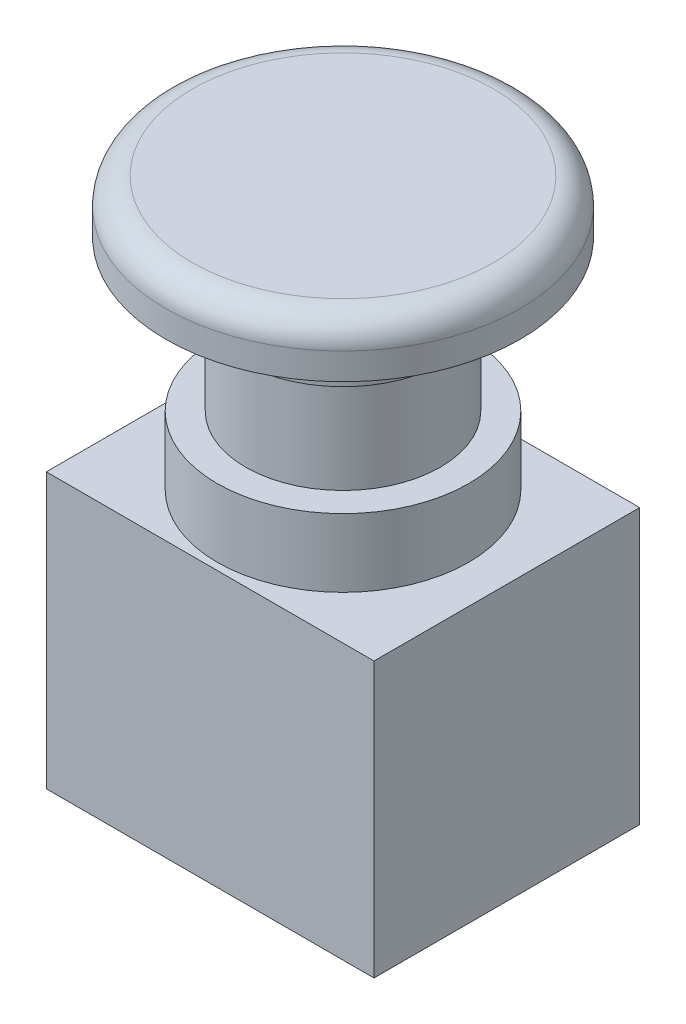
ISO-10303-21;
HEADER;
FILE_DESCRIPTION(('STEP AP214'),'2;1');
FILE_NAME('part.step','',(''),(''),'','','');
FILE_SCHEMA(('AUTOMOTIVE_DESIGN { 1 0 10303 214 1 1 1 1 }'));
ENDSEC;
DATA;
#1=APPLICATION_CONTEXT('core data for automotive mechanical design processes');
#2=APPLICATION_PROTOCOL_DEFINITION('international standard','automotive_design',2000,#1);
#3=PRODUCT_CONTEXT('',#1,'mechanical');
#4=PRODUCT('Part','Part','',(#3));
#5=PRODUCT_RELATED_PRODUCT_CATEGORY('part','',(#4));
#6=PRODUCT_DEFINITION_FORMATION('','',#4);
#7=PRODUCT_DEFINITION_CONTEXT('part definition',#1,'design');
#8=PRODUCT_DEFINITION('design','',#6,#7);
#9=PRODUCT_DEFINITION_SHAPE('','',#8);
#10=(LENGTH_UNIT() NAMED_UNIT(*) SI_UNIT(.MILLI.,.METRE.));
#11=(NAMED_UNIT(*) PLANE_ANGLE_UNIT() SI_UNIT($,.RADIAN.));
#12=(NAMED_UNIT(*) SI_UNIT($,.STERADIAN.) SOLID_ANGLE_UNIT());
#13=UNCERTAINTY_MEASURE_WITH_UNIT(LENGTH_MEASURE(1.E-05),#10,'distance_accuracy_value','');
#14=(GEOMETRIC_REPRESENTATION_CONTEXT(3) GLOBAL_UNCERTAINTY_ASSIGNED_CONTEXT((#13)) GLOBAL_UNIT_ASSIGNED_CONTEXT((#10,
#11,#12)) REPRESENTATION_CONTEXT('',''));
#15=CARTESIAN_POINT('',(0.,0.,0.));
#16=DIRECTION('',(0.,0.,1.));
#17=DIRECTION('',(1.,0.,0.));
#18=AXIS2_PLACEMENT_3D('',#15,#16,#17);
#19=CARTESIAN_POINT('',(18.5,31.,15.));
#20=DIRECTION('',(-1.,0.,0.));
#21=DIRECTION('',(0.,0.,1.));
#22=AXIS2_PLACEMENT_3D('',#19,#20,#21);
#23=PLANE('',#22);
#24=DIRECTION('',(0.,0.,-1.));
#25=VECTOR('',#24,1.);
#26=CARTESIAN_POINT('',(18.5,0.,15.));
#27=LINE('',#26,#25);
#28=CARTESIAN_POINT('',(18.5,0.,15.));
#29=VERTEX_POINT('',#28);
#30=CARTESIAN_POINT('',(18.5,0.,-15.));
#31=VERTEX_POINT('',#30);
#32=EDGE_CURVE('E107',#29,#31,#27,.T.);
#33=ORIENTED_EDGE('',*,*,#32,.T.);
#34=DIRECTION('',(0.,-1.,0.));
#35=VECTOR('',#34,1.);
#36=CARTESIAN_POINT('',(18.5,31.,-15.));
#37=LINE('',#36,#35);
#38=CARTESIAN_POINT('',(18.5,31.,-15.));
#39=VERTEX_POINT('',#38);
#40=EDGE_CURVE('E98',#39,#31,#37,.T.);
#41=ORIENTED_EDGE('',*,*,#40,.F.);
#42=DIRECTION('',(0.,0.,-1.));
#43=VECTOR('',#42,1.);
#44=CARTESIAN_POINT('',(18.5,31.,15.));
#45=LINE('',#44,#43);
#46=CARTESIAN_POINT('',(18.5,31.,15.));
#47=VERTEX_POINT('',#46);
#48=EDGE_CURVE('E92',#47,#39,#45,.T.);
#49=ORIENTED_EDGE('',*,*,#48,.F.);
#50=DIRECTION('',(0.,-1.,0.));
#51=VECTOR('',#50,1.);
#52=CARTESIAN_POINT('',(18.5,31.,15.));
#53=LINE('',#52,#51);
#54=EDGE_CURVE('E103',#47,#29,#53,.T.);
#55=ORIENTED_EDGE('',*,*,#54,.T.);
#56=EDGE_LOOP('',(#33,#41,#49,#55));
#57=FACE_BOUND('',#56,.T.);
#58=ADVANCED_FACE('F39',(#57),#23,.F.);
#59=CARTESIAN_POINT('',(-18.5,31.,-15.));
#60=DIRECTION('',(0.,0.,1.));
#61=DIRECTION('',(1.,0.,0.));
#62=AXIS2_PLACEMENT_3D('',#59,#60,#61);
#63=PLANE('',#62);
#64=DIRECTION('',(-1.,0.,0.));
#65=VECTOR('',#64,1.);
#66=CARTESIAN_POINT('',(-18.5,0.,-15.));
#67=LINE('',#66,#65);
#68=CARTESIAN_POINT('',(-18.5,0.,-15.));
#69=VERTEX_POINT('',#68);
#70=EDGE_CURVE('E97',#31,#69,#67,.T.);
#71=ORIENTED_EDGE('',*,*,#70,.T.);
#72=DIRECTION('',(0.,-1.,0.));
#73=VECTOR('',#72,1.);
#74=CARTESIAN_POINT('',(-18.5,31.,-15.));
#75=LINE('',#74,#73);
#76=CARTESIAN_POINT('',(-18.5,31.,-15.));
#77=VERTEX_POINT('',#76);
#78=EDGE_CURVE('E95',#77,#69,#75,.T.);
#79=ORIENTED_EDGE('',*,*,#78,.F.);
#80=DIRECTION('',(-1.,0.,0.));
#81=VECTOR('',#80,1.);
#82=CARTESIAN_POINT('',(-18.5,31.,-15.));
#83=LINE('',#82,#81);
#84=EDGE_CURVE('E87',#39,#77,#83,.T.);
#85=ORIENTED_EDGE('',*,*,#84,.F.);
#86=ORIENTED_EDGE('',*,*,#40,.T.);
#87=EDGE_LOOP('',(#71,#79,#85,#86));
#88=FACE_BOUND('',#87,.T.);
#89=ADVANCED_FACE('F96',(#88),#63,.F.);
#90=CARTESIAN_POINT('',(-18.5,31.,15.));
#91=DIRECTION('',(1.,0.,0.));
#92=DIRECTION('',(0.,0.,-1.));
#93=AXIS2_PLACEMENT_3D('',#90,#91,#92);
#94=PLANE('',#93);
#95=DIRECTION('',(0.,0.,1.));
#96=VECTOR('',#95,1.);
#97=CARTESIAN_POINT('',(-18.5,0.,15.));
#98=LINE('',#97,#96);
#99=CARTESIAN_POINT('',(-18.5,0.,15.));
#100=VERTEX_POINT('',#99);
#101=EDGE_CURVE('E73',#69,#100,#98,.T.);
#102=ORIENTED_EDGE('',*,*,#101,.T.);
#103=DIRECTION('',(0.,-1.,0.));
#104=VECTOR('',#103,1.);
#105=CARTESIAN_POINT('',(-18.5,31.,15.));
#106=LINE('',#105,#104);
#107=CARTESIAN_POINT('',(-18.5,31.,15.));
#108=VERTEX_POINT('',#107);
#109=EDGE_CURVE('E99',#108,#100,#106,.T.);
#110=ORIENTED_EDGE('',*,*,#109,.F.);
#111=DIRECTION('',(0.,0.,1.));
#112=VECTOR('',#111,1.);
#113=CARTESIAN_POINT('',(-18.5,31.,15.));
#114=LINE('',#113,#112);
#115=EDGE_CURVE('E90',#77,#108,#114,.T.);
#116=ORIENTED_EDGE('',*,*,#115,.F.);
#117=ORIENTED_EDGE('',*,*,#78,.T.);
#118=EDGE_LOOP('',(#102,#110,#116,#117));
#119=FACE_BOUND('',#118,.T.);
#120=ADVANCED_FACE('F101',(#119),#94,.F.);
#121=CARTESIAN_POINT('',(-18.5,31.,15.));
#122=DIRECTION('',(0.,0.,-1.));
#123=DIRECTION('',(-1.,0.,0.));
#124=AXIS2_PLACEMENT_3D('',#121,#122,#123);
#125=PLANE('',#124);
#126=DIRECTION('',(1.,0.,0.));
#127=VECTOR('',#126,1.);
#128=CARTESIAN_POINT('',(-18.5,0.,15.));
#129=LINE('',#128,#127);
#130=EDGE_CURVE('E79',#100,#29,#129,.T.);
#131=ORIENTED_EDGE('',*,*,#130,.T.);
#132=ORIENTED_EDGE('',*,*,#54,.F.);
#133=DIRECTION('',(1.,0.,0.));
#134=VECTOR('',#133,1.);
#135=CARTESIAN_POINT('',(-18.5,31.,15.));
#136=LINE('',#135,#134);
#137=EDGE_CURVE('E56',#108,#47,#136,.T.);
#138=ORIENTED_EDGE('',*,*,#137,.F.);
#139=ORIENTED_EDGE('',*,*,#109,.T.);
#140=EDGE_LOOP('',(#131,#132,#138,#139));
#141=FACE_BOUND('',#140,.T.);
#142=ADVANCED_FACE('F171',(#141),#125,.F.);
#143=CARTESIAN_POINT('',(0.,31.,0.));
#144=DIRECTION('',(0.,-1.,0.));
#145=DIRECTION('',(0.,0.,-1.));
#146=AXIS2_PLACEMENT_3D('',#143,#144,#145);
#147=PLANE('',#146);
#148=CARTESIAN_POINT('',(0.,31.,0.));
#149=DIRECTION('',(0.,1.,0.));
#150=DIRECTION('',(0.,0.,1.));
#151=AXIS2_PLACEMENT_3D('',#148,#149,#150);
#152=CIRCLE('',#151,14.2);
#153=CARTESIAN_POINT('',(0.,31.,-14.2));
#154=VERTEX_POINT('',#153);
#155=EDGE_CURVE('E116',#154,#154,#152,.T.);
#156=ORIENTED_EDGE('',*,*,#155,.F.);
#157=EDGE_LOOP('',(#156));
#158=FACE_BOUND('',#157,.T.);
#159=ORIENTED_EDGE('',*,*,#48,.T.);
#160=ORIENTED_EDGE('',*,*,#84,.T.);
#161=ORIENTED_EDGE('',*,*,#115,.T.);
#162=ORIENTED_EDGE('',*,*,#137,.T.);
#163=EDGE_LOOP('',(#159,#160,#161,#162));
#164=FACE_BOUND('',#163,.T.);
#165=ADVANCED_FACE('F88',(#158,#164),#147,.F.);
#166=CARTESIAN_POINT('',(0.,0.,0.));
#167=DIRECTION('',(0.,-1.,0.));
#168=DIRECTION('',(0.,0.,-1.));
#169=AXIS2_PLACEMENT_3D('',#166,#167,#168);
#170=PLANE('',#169);
#171=ORIENTED_EDGE('',*,*,#32,.F.);
#172=ORIENTED_EDGE('',*,*,#130,.F.);
#173=ORIENTED_EDGE('',*,*,#101,.F.);
#174=ORIENTED_EDGE('',*,*,#70,.F.);
#175=EDGE_LOOP('',(#171,#172,#173,#174));
#176=FACE_BOUND('',#175,.T.);
#177=ADVANCED_FACE('F174',(#176),#170,.T.);
#178=CARTESIAN_POINT('',(0.,38.7,0.));
#179=DIRECTION('',(0.,-1.,0.));
#180=DIRECTION('',(0.,0.,-1.));
#181=AXIS2_PLACEMENT_3D('',#178,#179,#180);
#182=CYLINDRICAL_SURFACE('',#181,14.2);
#183=CARTESIAN_POINT('',(0.,38.7,0.));
#184=DIRECTION('',(0.,1.,0.));
#185=DIRECTION('',(0.,0.,1.));
#186=AXIS2_PLACEMENT_3D('',#183,#184,#185);
#187=CIRCLE('',#186,14.2);
#188=CARTESIAN_POINT('',(0.,38.7,-14.2));
#189=VERTEX_POINT('',#188);
#190=EDGE_CURVE('E110',#189,#189,#187,.T.);
#191=CARTESIAN_POINT('',(0.,38.7,-14.2));
#192=CARTESIAN_POINT('',(0.,38.6197916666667,-14.2));
#193=CARTESIAN_POINT('',(0.,38.5395833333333,-14.2));
#194=CARTESIAN_POINT('',(0.,38.3791666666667,-14.2));
#195=CARTESIAN_POINT('',(0.,38.2989583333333,-14.2));
#196=CARTESIAN_POINT('',(0.,38.1385416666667,-14.2));
#197=CARTESIAN_POINT('',(0.,38.0583333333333,-14.2));
#198=CARTESIAN_POINT('',(0.,37.8979166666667,-14.2));
#199=CARTESIAN_POINT('',(0.,37.8177083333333,-14.2));
#200=CARTESIAN_POINT('',(0.,37.6572916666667,-14.2));
#201=CARTESIAN_POINT('',(0.,37.5770833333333,-14.2));
#202=CARTESIAN_POINT('',(0.,37.4166666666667,-14.2));
#203=CARTESIAN_POINT('',(0.,37.3364583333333,-14.2));
#204=CARTESIAN_POINT('',(0.,37.1760416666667,-14.2));
#205=CARTESIAN_POINT('',(0.,37.0958333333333,-14.2));
#206=CARTESIAN_POINT('',(0.,36.9354166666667,-14.2));
#207=CARTESIAN_POINT('',(0.,36.8552083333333,-14.2));
#208=CARTESIAN_POINT('',(0.,36.6947916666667,-14.2));
#209=CARTESIAN_POINT('',(0.,36.6145833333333,-14.2));
#210=CARTESIAN_POINT('',(0.,36.4541666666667,-14.2));
#211=CARTESIAN_POINT('',(0.,36.3739583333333,-14.2));
#212=CARTESIAN_POINT('',(0.,36.2135416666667,-14.2));
#213=CARTESIAN_POINT('',(0.,36.1333333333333,-14.2));
#214=CARTESIAN_POINT('',(0.,35.9729166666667,-14.2));
#215=CARTESIAN_POINT('',(0.,35.8927083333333,-14.2));
#216=CARTESIAN_POINT('',(0.,35.7322916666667,-14.2));
#217=CARTESIAN_POINT('',(0.,35.6520833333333,-14.2));
#218=CARTESIAN_POINT('',(0.,35.4916666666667,-14.2));
#219=CARTESIAN_POINT('',(0.,35.4114583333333,-14.2));
#220=CARTESIAN_POINT('',(0.,35.2510416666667,-14.2));
#221=CARTESIAN_POINT('',(0.,35.1708333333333,-14.2));
#222=CARTESIAN_POINT('',(0.,35.0104166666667,-14.2));
#223=CARTESIAN_POINT('',(0.,34.9302083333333,-14.2));
#224=CARTESIAN_POINT('',(0.,34.7697916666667,-14.2));
#225=CARTESIAN_POINT('',(0.,34.6895833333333,-14.2));
#226=CARTESIAN_POINT('',(0.,34.5291666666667,-14.2));
#227=CARTESIAN_POINT('',(0.,34.4489583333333,-14.2));
#228=CARTESIAN_POINT('',(0.,34.2885416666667,-14.2));
#229=CARTESIAN_POINT('',(0.,34.2083333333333,-14.2));
#230=CARTESIAN_POINT('',(0.,34.0479166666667,-14.2));
#231=CARTESIAN_POINT('',(0.,33.9677083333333,-14.2));
#232=CARTESIAN_POINT('',(0.,33.8072916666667,-14.2));
#233=CARTESIAN_POINT('',(0.,33.7270833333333,-14.2));
#234=CARTESIAN_POINT('',(0.,33.5666666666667,-14.2));
#235=CARTESIAN_POINT('',(0.,33.4864583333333,-14.2));
#236=CARTESIAN_POINT('',(0.,33.3260416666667,-14.2));
#237=CARTESIAN_POINT('',(0.,33.2458333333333,-14.2));
#238=CARTESIAN_POINT('',(0.,33.0854166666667,-14.2));
#239=CARTESIAN_POINT('',(0.,33.0052083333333,-14.2));
#240=CARTESIAN_POINT('',(0.,32.8447916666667,-14.2));
#241=CARTESIAN_POINT('',(0.,32.7645833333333,-14.2));
#242=CARTESIAN_POINT('',(0.,32.6041666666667,-14.2));
#243=CARTESIAN_POINT('',(0.,32.5239583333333,-14.2));
#244=CARTESIAN_POINT('',(0.,32.3635416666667,-14.2));
#245=CARTESIAN_POINT('',(0.,32.2833333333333,-14.2));
#246=CARTESIAN_POINT('',(0.,32.1229166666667,-14.2));
#247=CARTESIAN_POINT('',(0.,32.0427083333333,-14.2));
#248=CARTESIAN_POINT('',(0.,31.8822916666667,-14.2));
#249=CARTESIAN_POINT('',(0.,31.8020833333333,-14.2));
#250=CARTESIAN_POINT('',(0.,31.6416666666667,-14.2));
#251=CARTESIAN_POINT('',(0.,31.5614583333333,-14.2));
#252=CARTESIAN_POINT('',(0.,31.4010416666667,-14.2));
#253=CARTESIAN_POINT('',(0.,31.3208333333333,-14.2));
#254=CARTESIAN_POINT('',(0.,31.1604166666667,-14.2));
#255=CARTESIAN_POINT('',(0.,31.0802083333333,-14.2));
#256=CARTESIAN_POINT('',(0.,31.,-14.2));
#257=B_SPLINE_CURVE_WITH_KNOTS('',3,(#191,#192,#193,#194,#195,#196,#197,#198,#199,#200,#201,
#202,#203,#204,#205,#206,#207,#208,#209,#210,#211,#212,#213,#214,#215,#216,#217,#218,#219,#220,
#221,#222,#223,#224,#225,#226,#227,#228,#229,#230,#231,#232,#233,#234,#235,#236,#237,#238,#239,
#240,#241,#242,#243,#244,#245,#246,#247,#248,#249,#250,#251,#252,#253,#254,#255,#256),
.UNSPECIFIED.,.F.,.F.,(4,2,2,2,2,2,2,2,2,2,2,2,2,2,2,2,2,2,2,2,2,2,2,2,2,2,2,2,2,2,2,2,4),(0.,
0.240624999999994,0.481249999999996,0.721874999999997,0.962499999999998,1.203125,
1.44374999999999,1.68437499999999,1.925,2.165625,2.40625,2.64687499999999,2.88749999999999,
3.128125,3.36875,3.609375,3.84999999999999,4.09062499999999,4.33124999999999,4.571875,4.8125,
5.05312499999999,5.29374999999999,5.53437499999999,5.775,6.015625,6.25625,6.49687499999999,
6.73749999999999,6.978125,7.21875,7.45937499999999,7.69999999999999),.UNSPECIFIED.);
#258=EDGE_CURVE('BSEAM177',#189,#154,#257,.T.);
#259=ORIENTED_EDGE('',*,*,#190,.F.);
#260=ORIENTED_EDGE('',*,*,#155,.T.);
#261=ORIENTED_EDGE('',*,*,#258,.T.);
#262=ORIENTED_EDGE('',*,*,#258,.F.);
#263=EDGE_LOOP('',(#259,#261,#260,#262));
#264=FACE_BOUND('',#263,.T.);
#265=ADVANCED_FACE('F177',(#264),#182,.T.);
#266=CARTESIAN_POINT('',(0.,38.7,0.));
#267=DIRECTION('',(0.,1.,0.));
#268=DIRECTION('',(0.,0.,1.));
#269=AXIS2_PLACEMENT_3D('',#266,#267,#268);
#270=PLANE('',#269);
#271=CARTESIAN_POINT('',(0.,38.7,0.));
#272=DIRECTION('',(0.,1.,0.));
#273=DIRECTION('',(0.,0.,1.));
#274=AXIS2_PLACEMENT_3D('',#271,#272,#273);
#275=CIRCLE('',#274,11.);
#276=CARTESIAN_POINT('',(0.,38.7,-11.));
#277=VERTEX_POINT('',#276);
#278=EDGE_CURVE('E118',#277,#277,#275,.T.);
#279=ORIENTED_EDGE('',*,*,#278,.F.);
#280=EDGE_LOOP('',(#279));
#281=FACE_BOUND('',#280,.T.);
#282=ORIENTED_EDGE('',*,*,#190,.T.);
#283=EDGE_LOOP('',(#282));
#284=FACE_BOUND('',#283,.T.);
#285=ADVANCED_FACE('F184',(#281,#284),#270,.T.);
#286=CARTESIAN_POINT('',(0.,49.2,0.));
#287=DIRECTION('',(0.,-1.,0.));
#288=DIRECTION('',(0.,0.,-1.));
#289=AXIS2_PLACEMENT_3D('',#286,#287,#288);
#290=CYLINDRICAL_SURFACE('',#289,11.);
#291=CARTESIAN_POINT('',(0.,49.2,0.));
#292=DIRECTION('',(0.,1.,0.));
#293=DIRECTION('',(0.,0.,1.));
#294=AXIS2_PLACEMENT_3D('',#291,#292,#293);
#295=CIRCLE('',#294,11.);
#296=CARTESIAN_POINT('',(0.,49.2,-11.));
#297=VERTEX_POINT('',#296);
#298=EDGE_CURVE('E129',#297,#297,#295,.T.);
#299=CARTESIAN_POINT('',(0.,49.2,-11.));
#300=CARTESIAN_POINT('',(0.,49.090625,-11.));
#301=CARTESIAN_POINT('',(0.,48.98125,-11.));
#302=CARTESIAN_POINT('',(0.,48.7625,-11.));
#303=CARTESIAN_POINT('',(0.,48.653125,-11.));
#304=CARTESIAN_POINT('',(0.,48.434375,-11.));
#305=CARTESIAN_POINT('',(0.,48.325,-11.));
#306=CARTESIAN_POINT('',(0.,48.10625,-11.));
#307=CARTESIAN_POINT('',(0.,47.996875,-11.));
#308=CARTESIAN_POINT('',(0.,47.778125,-11.));
#309=CARTESIAN_POINT('',(0.,47.66875,-11.));
#310=CARTESIAN_POINT('',(0.,47.45,-11.));
#311=CARTESIAN_POINT('',(0.,47.340625,-11.));
#312=CARTESIAN_POINT('',(0.,47.121875,-11.));
#313=CARTESIAN_POINT('',(0.,47.0125,-11.));
#314=CARTESIAN_POINT('',(0.,46.79375,-11.));
#315=CARTESIAN_POINT('',(0.,46.684375,-11.));
#316=CARTESIAN_POINT('',(0.,46.465625,-11.));
#317=CARTESIAN_POINT('',(0.,46.35625,-11.));
#318=CARTESIAN_POINT('',(0.,46.1375,-11.));
#319=CARTESIAN_POINT('',(0.,46.028125,-11.));
#320=CARTESIAN_POINT('',(0.,45.809375,-11.));
#321=CARTESIAN_POINT('',(0.,45.7,-11.));
#322=CARTESIAN_POINT('',(0.,45.48125,-11.));
#323=CARTESIAN_POINT('',(0.,45.371875,-11.));
#324=CARTESIAN_POINT('',(0.,45.153125,-11.));
#325=CARTESIAN_POINT('',(0.,45.04375,-11.));
#326=CARTESIAN_POINT('',(0.,44.825,-11.));
#327=CARTESIAN_POINT('',(0.,44.715625,-11.));
#328=CARTESIAN_POINT('',(0.,44.496875,-11.));
#329=CARTESIAN_POINT('',(0.,44.3875,-11.));
#330=CARTESIAN_POINT('',(0.,44.16875,-11.));
#331=CARTESIAN_POINT('',(0.,44.059375,-11.));
#332=CARTESIAN_POINT('',(0.,43.840625,-11.));
#333=CARTESIAN_POINT('',(0.,43.73125,-11.));
#334=CARTESIAN_POINT('',(0.,43.5125,-11.));
#335=CARTESIAN_POINT('',(0.,43.403125,-11.));
#336=CARTESIAN_POINT('',(0.,43.184375,-11.));
#337=CARTESIAN_POINT('',(0.,43.075,-11.));
#338=CARTESIAN_POINT('',(0.,42.85625,-11.));
#339=CARTESIAN_POINT('',(0.,42.746875,-11.));
#340=CARTESIAN_POINT('',(0.,42.528125,-11.));
#341=CARTESIAN_POINT('',(0.,42.41875,-11.));
#342=CARTESIAN_POINT('',(0.,42.2,-11.));
#343=CARTESIAN_POINT('',(0.,42.090625,-11.));
#344=CARTESIAN_POINT('',(0.,41.871875,-11.));
#345=CARTESIAN_POINT('',(0.,41.7625,-11.));
#346=CARTESIAN_POINT('',(0.,41.54375,-11.));
#347=CARTESIAN_POINT('',(0.,41.434375,-11.));
#348=CARTESIAN_POINT('',(0.,41.215625,-11.));
#349=CARTESIAN_POINT('',(0.,41.10625,-11.));
#350=CARTESIAN_POINT('',(0.,40.8875,-11.));
#351=CARTESIAN_POINT('',(0.,40.778125,-11.));
#352=CARTESIAN_POINT('',(0.,40.559375,-11.));
#353=CARTESIAN_POINT('',(0.,40.45,-11.));
#354=CARTESIAN_POINT('',(0.,40.23125,-11.));
#355=CARTESIAN_POINT('',(0.,40.121875,-11.));
#356=CARTESIAN_POINT('',(0.,39.903125,-11.));
#357=CARTESIAN_POINT('',(0.,39.79375,-11.));
#358=CARTESIAN_POINT('',(0.,39.575,-11.));
#359=CARTESIAN_POINT('',(0.,39.465625,-11.));
#360=CARTESIAN_POINT('',(0.,39.246875,-11.));
#361=CARTESIAN_POINT('',(0.,39.1375,-11.));
#362=CARTESIAN_POINT('',(0.,38.91875,-11.));
#363=CARTESIAN_POINT('',(0.,38.809375,-11.));
#364=CARTESIAN_POINT('',(0.,38.7,-11.));
#365=B_SPLINE_CURVE_WITH_KNOTS('',3,(#299,#300,#301,#302,#303,#304,#305,#306,#307,#308,#309,
#310,#311,#312,#313,#314,#315,#316,#317,#318,#319,#320,#321,#322,#323,#324,#325,#326,#327,#328,
#329,#330,#331,#332,#333,#334,#335,#336,#337,#338,#339,#340,#341,#342,#343,#344,#345,#346,#347,
#348,#349,#350,#351,#352,#353,#354,#355,#356,#357,#358,#359,#360,#361,#362,#363,#364),
.UNSPECIFIED.,.F.,.F.,(4,2,2,2,2,2,2,2,2,2,2,2,2,2,2,2,2,2,2,2,2,2,2,2,2,2,2,2,2,2,2,2,4),(0.,
0.328125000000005,0.656250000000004,0.984375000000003,1.3125,1.64062500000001,1.96875000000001,
2.296875,2.625,2.95312500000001,3.28125000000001,3.609375,3.9375,4.265625,4.59375000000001,
4.92187500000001,5.25,5.578125,5.90625000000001,6.23437500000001,6.56250000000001,6.890625,
7.21875,7.54687500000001,7.87500000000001,8.20312500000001,8.53125,8.85937500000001,
9.18750000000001,9.51562500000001,9.84375000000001,10.171875,10.5),.UNSPECIFIED.);
#366=EDGE_CURVE('BSEAM188',#297,#277,#365,.T.);
#367=ORIENTED_EDGE('',*,*,#298,.F.);
#368=ORIENTED_EDGE('',*,*,#278,.T.);
#369=ORIENTED_EDGE('',*,*,#366,.T.);
#370=ORIENTED_EDGE('',*,*,#366,.F.);
#371=EDGE_LOOP('',(#367,#369,#368,#370));
#372=FACE_BOUND('',#371,.T.);
#373=ADVANCED_FACE('F188',(#372),#290,.T.);
#374=CARTESIAN_POINT('',(0.,55.7,0.));
#375=DIRECTION('',(0.,-1.,0.));
#376=DIRECTION('',(0.,0.,-1.));
#377=AXIS2_PLACEMENT_3D('',#374,#375,#376);
#378=CYLINDRICAL_SURFACE('',#377,11.5);
#379=CARTESIAN_POINT('',(0.,55.7,0.));
#380=DIRECTION('',(0.,1.,0.));
#381=DIRECTION('',(0.,0.,1.));
#382=AXIS2_PLACEMENT_3D('',#379,#380,#381);
#383=CIRCLE('',#382,11.5);
#384=CARTESIAN_POINT('',(0.,55.7,-11.5));
#385=VERTEX_POINT('',#384);
#386=EDGE_CURVE('E135',#385,#385,#383,.T.);
#387=CARTESIAN_POINT('',(0.,49.2,0.));
#388=DIRECTION('',(0.,1.,0.));
#389=DIRECTION('',(0.,0.,1.));
#390=AXIS2_PLACEMENT_3D('',#387,#388,#389);
#391=CIRCLE('',#390,11.5);
#392=CARTESIAN_POINT('',(0.,49.2,-11.5));
#393=VERTEX_POINT('',#392);
#394=EDGE_CURVE('E139',#393,#393,#391,.T.);
#395=CARTESIAN_POINT('',(0.,55.7,-11.5));
#396=CARTESIAN_POINT('',(0.,55.6322916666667,-11.5));
#397=CARTESIAN_POINT('',(0.,55.5645833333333,-11.5));
#398=CARTESIAN_POINT('',(0.,55.4291666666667,-11.5));
#399=CARTESIAN_POINT('',(0.,55.3614583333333,-11.5));
#400=CARTESIAN_POINT('',(0.,55.2260416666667,-11.5));
#401=CARTESIAN_POINT('',(0.,55.1583333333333,-11.5));
#402=CARTESIAN_POINT('',(0.,55.0229166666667,-11.5));
#403=CARTESIAN_POINT('',(0.,54.9552083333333,-11.5));
#404=CARTESIAN_POINT('',(0.,54.8197916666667,-11.5));
#405=CARTESIAN_POINT('',(0.,54.7520833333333,-11.5));
#406=CARTESIAN_POINT('',(0.,54.6166666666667,-11.5));
#407=CARTESIAN_POINT('',(0.,54.5489583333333,-11.5));
#408=CARTESIAN_POINT('',(0.,54.4135416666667,-11.5));
#409=CARTESIAN_POINT('',(0.,54.3458333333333,-11.5));
#410=CARTESIAN_POINT('',(0.,54.2104166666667,-11.5));
#411=CARTESIAN_POINT('',(0.,54.1427083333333,-11.5));
#412=CARTESIAN_POINT('',(0.,54.0072916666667,-11.5));
#413=CARTESIAN_POINT('',(0.,53.9395833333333,-11.5));
#414=CARTESIAN_POINT('',(0.,53.8041666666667,-11.5));
#415=CARTESIAN_POINT('',(0.,53.7364583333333,-11.5));
#416=CARTESIAN_POINT('',(0.,53.6010416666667,-11.5));
#417=CARTESIAN_POINT('',(0.,53.5333333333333,-11.5));
#418=CARTESIAN_POINT('',(0.,53.3979166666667,-11.5));
#419=CARTESIAN_POINT('',(0.,53.3302083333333,-11.5));
#420=CARTESIAN_POINT('',(0.,53.1947916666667,-11.5));
#421=CARTESIAN_POINT('',(0.,53.1270833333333,-11.5));
#422=CARTESIAN_POINT('',(0.,52.9916666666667,-11.5));
#423=CARTESIAN_POINT('',(0.,52.9239583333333,-11.5));
#424=CARTESIAN_POINT('',(0.,52.7885416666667,-11.5));
#425=CARTESIAN_POINT('',(0.,52.7208333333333,-11.5));
#426=CARTESIAN_POINT('',(0.,52.5854166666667,-11.5));
#427=CARTESIAN_POINT('',(0.,52.5177083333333,-11.5));
#428=CARTESIAN_POINT('',(0.,52.3822916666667,-11.5));
#429=CARTESIAN_POINT('',(0.,52.3145833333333,-11.5));
#430=CARTESIAN_POINT('',(0.,52.1791666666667,-11.5));
#431=CARTESIAN_POINT('',(0.,52.1114583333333,-11.5));
#432=CARTESIAN_POINT('',(0.,51.9760416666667,-11.5));
#433=CARTESIAN_POINT('',(0.,51.9083333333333,-11.5));
#434=CARTESIAN_POINT('',(0.,51.7729166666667,-11.5));
#435=CARTESIAN_POINT('',(0.,51.7052083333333,-11.5));
#436=CARTESIAN_POINT('',(0.,51.5697916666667,-11.5));
#437=CARTESIAN_POINT('',(0.,51.5020833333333,-11.5));
#438=CARTESIAN_POINT('',(0.,51.3666666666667,-11.5));
#439=CARTESIAN_POINT('',(0.,51.2989583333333,-11.5));
#440=CARTESIAN_POINT('',(0.,51.1635416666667,-11.5));
#441=CARTESIAN_POINT('',(0.,51.0958333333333,-11.5));
#442=CARTESIAN_POINT('',(0.,50.9604166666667,-11.5));
#443=CARTESIAN_POINT('',(0.,50.8927083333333,-11.5));
#444=CARTESIAN_POINT('',(0.,50.7572916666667,-11.5));
#445=CARTESIAN_POINT('',(0.,50.6895833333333,-11.5));
#446=CARTESIAN_POINT('',(0.,50.5541666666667,-11.5));
#447=CARTESIAN_POINT('',(0.,50.4864583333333,-11.5));
#448=CARTESIAN_POINT('',(0.,50.3510416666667,-11.5));
#449=CARTESIAN_POINT('',(0.,50.2833333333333,-11.5));
#450=CARTESIAN_POINT('',(0.,50.1479166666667,-11.5));
#451=CARTESIAN_POINT('',(0.,50.0802083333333,-11.5));
#452=CARTESIAN_POINT('',(0.,49.9447916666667,-11.5));
#453=CARTESIAN_POINT('',(0.,49.8770833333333,-11.5));
#454=CARTESIAN_POINT('',(0.,49.7416666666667,-11.5));
#455=CARTESIAN_POINT('',(0.,49.6739583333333,-11.5));
#456=CARTESIAN_POINT('',(0.,49.5385416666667,-11.5));
#457=CARTESIAN_POINT('',(0.,49.4708333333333,-11.5));
#458=CARTESIAN_POINT('',(0.,49.3354166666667,-11.5));
#459=CARTESIAN_POINT('',(0.,49.2677083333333,-11.5));
#460=CARTESIAN_POINT('',(0.,49.2,-11.5));
#461=B_SPLINE_CURVE_WITH_KNOTS('',3,(#395,#396,#397,#398,#399,#400,#401,#402,#403,#404,#405,
#406,#407,#408,#409,#410,#411,#412,#413,#414,#415,#416,#417,#418,#419,#420,#421,#422,#423,#424,
#425,#426,#427,#428,#429,#430,#431,#432,#433,#434,#435,#436,#437,#438,#439,#440,#441,#442,#443,
#444,#445,#446,#447,#448,#449,#450,#451,#452,#453,#454,#455,#456,#457,#458,#459,#460),
.UNSPECIFIED.,.F.,.F.,(4,2,2,2,2,2,2,2,2,2,2,2,2,2,2,2,2,2,2,2,2,2,2,2,2,2,2,2,2,2,2,2,4),(0.,
0.203124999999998,0.406249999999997,0.609374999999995,0.812499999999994,1.015625,1.21875,
1.421875,1.62499999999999,1.82812499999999,2.03125,2.234375,2.4375,2.64062499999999,2.84375,
3.046875,3.25,3.45312499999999,3.65624999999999,3.859375,4.0625,4.26562499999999,
4.46874999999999,4.67187499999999,4.875,5.078125,5.28124999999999,5.48437499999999,
5.68749999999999,5.890625,6.09374999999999,6.29687499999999,6.49999999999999),.UNSPECIFIED.);
#462=EDGE_CURVE('BSEAM192',#385,#393,#461,.T.);
#463=ORIENTED_EDGE('',*,*,#386,.F.);
#464=ORIENTED_EDGE('',*,*,#394,.T.);
#465=ORIENTED_EDGE('',*,*,#462,.T.);
#466=ORIENTED_EDGE('',*,*,#462,.F.);
#467=EDGE_LOOP('',(#463,#465,#464,#466));
#468=FACE_BOUND('',#467,.T.);
#469=ADVANCED_FACE('F192',(#468),#378,.T.);
#470=CARTESIAN_POINT('',(0.,49.2,0.));
#471=DIRECTION('',(0.,1.,0.));
#472=DIRECTION('',(0.,0.,1.));
#473=AXIS2_PLACEMENT_3D('',#470,#471,#472);
#474=PLANE('',#473);
#475=ORIENTED_EDGE('',*,*,#298,.T.);
#476=EDGE_LOOP('',(#475));
#477=FACE_BOUND('',#476,.T.);
#478=ORIENTED_EDGE('',*,*,#394,.F.);
#479=EDGE_LOOP('',(#478));
#480=FACE_BOUND('',#479,.T.);
#481=ADVANCED_FACE('F196',(#477,#480),#474,.F.);
#482=CARTESIAN_POINT('',(0.,61.7,0.));
#483=DIRECTION('',(0.,-1.,0.));
#484=DIRECTION('',(0.,0.,-1.));
#485=AXIS2_PLACEMENT_3D('',#482,#483,#484);
#486=CYLINDRICAL_SURFACE('',#485,20.);
#487=CARTESIAN_POINT('',(0.,58.7,0.));
#488=DIRECTION('',(0.,1.,0.));
#489=DIRECTION('',(0.,0.,1.));
#490=AXIS2_PLACEMENT_3D('',#487,#488,#489);
#491=CIRCLE('',#490,20.);
#492=CARTESIAN_POINT('',(0.,58.7,20.));
#493=VERTEX_POINT('',#492);
#494=EDGE_CURVE('E11',#493,#493,#491,.F.);
#495=ORIENTED_EDGE('',*,*,#494,.T.);
#496=EDGE_LOOP('',(#495));
#497=FACE_BOUND('',#496,.T.);
#498=CARTESIAN_POINT('',(0.,55.7,0.));
#499=DIRECTION('',(0.,1.,0.));
#500=DIRECTION('',(0.,0.,1.));
#501=AXIS2_PLACEMENT_3D('',#498,#499,#500);
#502=CIRCLE('',#501,20.);
#503=CARTESIAN_POINT('',(0.,55.7,20.));
#504=VERTEX_POINT('',#503);
#505=EDGE_CURVE('E144',#504,#504,#502,.T.);
#506=ORIENTED_EDGE('',*,*,#505,.T.);
#507=EDGE_LOOP('',(#506));
#508=FACE_BOUND('',#507,.T.);
#509=ADVANCED_FACE('F149',(#497,#508),#486,.T.);
#510=CARTESIAN_POINT('',(0.,61.7,0.));
#511=DIRECTION('',(0.,1.,0.));
#512=DIRECTION('',(0.,0.,1.));
#513=AXIS2_PLACEMENT_3D('',#510,#511,#512);
#514=PLANE('',#513);
#515=CARTESIAN_POINT('',(0.,61.7,0.));
#516=DIRECTION('',(0.,1.,0.));
#517=DIRECTION('',(0.,0.,1.));
#518=AXIS2_PLACEMENT_3D('',#515,#516,#517);
#519=CIRCLE('',#518,17.);
#520=CARTESIAN_POINT('',(0.,61.7,17.));
#521=VERTEX_POINT('',#520);
#522=EDGE_CURVE('E48',#521,#521,#519,.T.);
#523=ORIENTED_EDGE('',*,*,#522,.T.);
#524=EDGE_LOOP('',(#523));
#525=FACE_BOUND('',#524,.T.);
#526=ADVANCED_FACE('F153',(#525),#514,.T.);
#527=CARTESIAN_POINT('',(0.,55.7,0.));
#528=DIRECTION('',(0.,1.,0.));
#529=DIRECTION('',(0.,0.,1.));
#530=AXIS2_PLACEMENT_3D('',#527,#528,#529);
#531=PLANE('',#530);
#532=ORIENTED_EDGE('',*,*,#386,.T.);
#533=EDGE_LOOP('',(#532));
#534=FACE_BOUND('',#533,.T.);
#535=ORIENTED_EDGE('',*,*,#505,.F.);
#536=EDGE_LOOP('',(#535));
#537=FACE_BOUND('',#536,.T.);
#538=ADVANCED_FACE('F151',(#534,#537),#531,.F.);
#539=CARTESIAN_POINT('',(0.,58.7,0.));
#540=DIRECTION('',(0.,1.,0.));
#541=DIRECTION('',(0.,0.,1.));
#542=AXIS2_PLACEMENT_3D('',#539,#540,#541);
#543=TOROIDAL_SURFACE('',#542,17.,3.);
#544=ORIENTED_EDGE('',*,*,#494,.F.);
#545=EDGE_LOOP('',(#544));
#546=FACE_BOUND('',#545,.T.);
#547=ORIENTED_EDGE('',*,*,#522,.F.);
#548=EDGE_LOOP('',(#547));
#549=FACE_BOUND('',#548,.T.);
#550=ADVANCED_FACE('F41',(#546,#549),#543,.T.);
#551=CLOSED_SHELL('',(#58,#89,#120,#142,#165,#177,#265,#285,#373,#469,#481,#509,#526,#538,#550));
#552=MANIFOLD_SOLID_BREP('B2',#551);
#553=ADVANCED_BREP_SHAPE_REPRESENTATION('',(#18,#552),#14);
#554=SHAPE_DEFINITION_REPRESENTATION(#9,#553);
ENDSEC;
END-ISO-10303-21;
